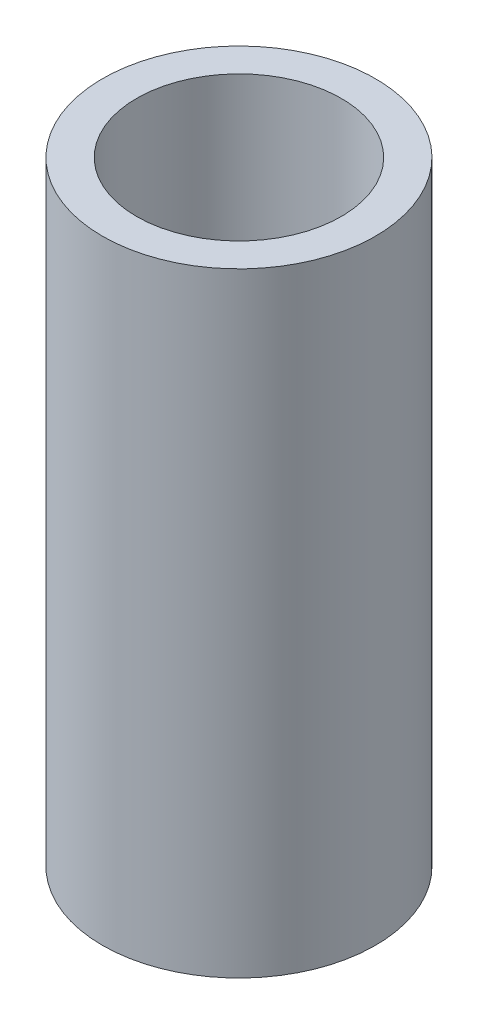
from build123d import *

# Parameters (mm, degrees)
SKETCH1_R           = 2
SKETCH1_R_2         = 1.5
BOSS_EXTRUDE1_DEPTH = 9


with BuildPart() as part:
    # Sketch1 → Boss-Extrude1 (new body)
    with BuildSketch(Plane(origin=(0, 0, 0), x_dir=(1, 0, 0), z_dir=(0, 1, 0))):
        with Locations(Location((0, 0, 0), (0, 0, 270))):
            Circle(SKETCH1_R)
        with Locations(Location((0, 0, 0), (0, 0, 270))):
            Circle(SKETCH1_R_2, mode=Mode.SUBTRACT)
    extrude(amount=BOSS_EXTRUDE1_DEPTH)


solid = part.part
